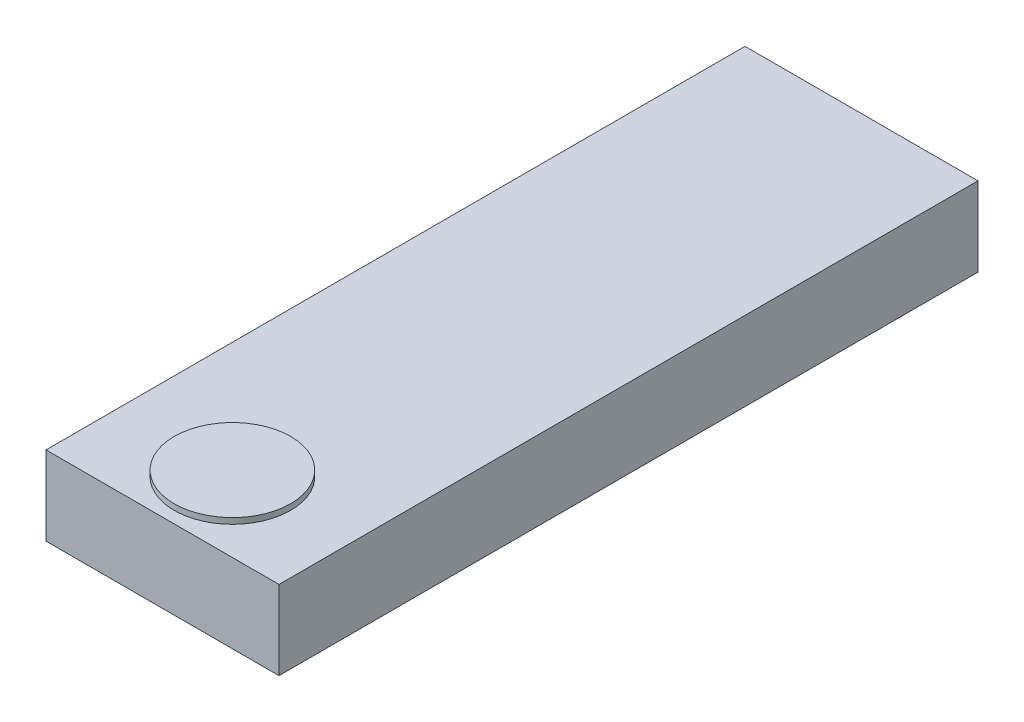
from build123d import *

# Parameters (mm, degrees)
SKETCH1_W           = 50.8
SKETCH1_H           = 17.232996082
BOSS_EXTRUDE1_DEPTH = 152.4
SKETCH2_R           = 12.7
BOSS_EXTRUDE2_DEPTH = 1.27


with BuildPart() as part:
    # Sketch1 → Boss-Extrude1 (new body)
    with BuildSketch(Plane.XY):
        with Locations((0, -8.616498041)):
            Rectangle(SKETCH1_W, SKETCH1_H)
    extrude(amount=BOSS_EXTRUDE1_DEPTH)

    # Sketch2 → Boss-Extrude2 (add)
    with BuildSketch(Plane(origin=(0, 0, 0), x_dir=(1, 0, 0), z_dir=(0, 1, 0))):
        with Locations(Location((0, -137.16, 0), (0, 0, 90))):
            Circle(SKETCH2_R)
    extrude(amount=BOSS_EXTRUDE2_DEPTH)


solid = part.part
